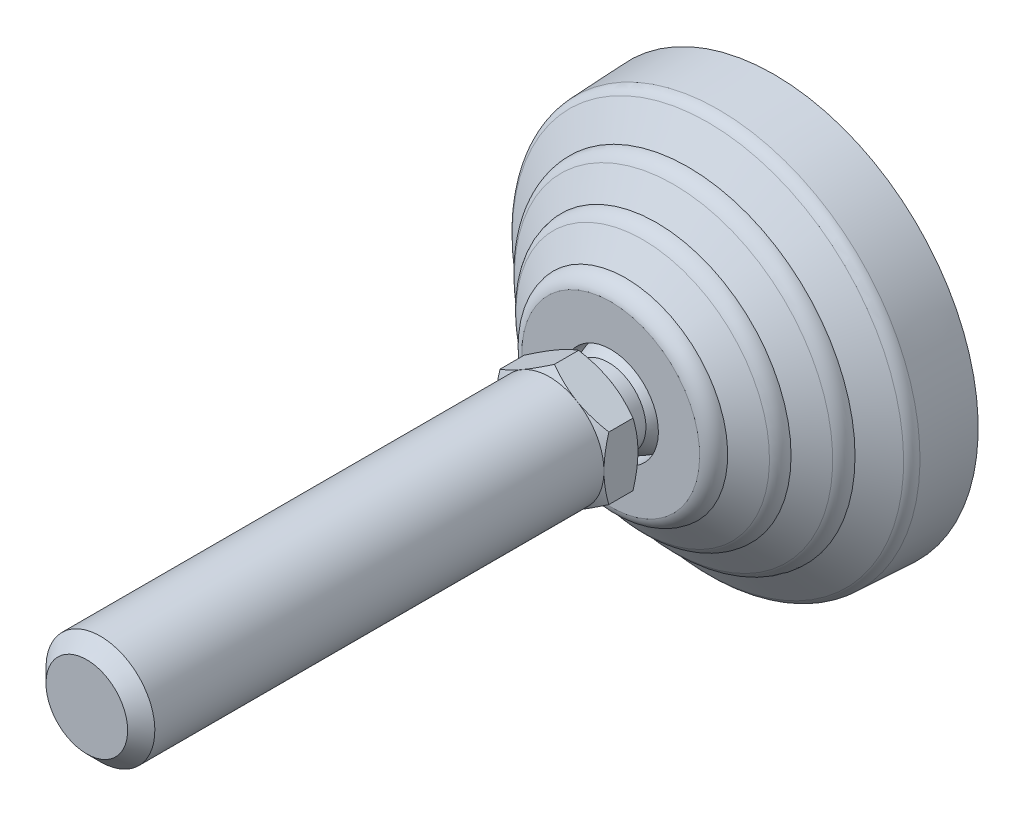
ISO-10303-21;
HEADER;
FILE_DESCRIPTION(('STEP AP214'),'2;1');
FILE_NAME('part.step','',(''),(''),'','','');
FILE_SCHEMA(('AUTOMOTIVE_DESIGN { 1 0 10303 214 1 1 1 1 }'));
ENDSEC;
DATA;
#1=APPLICATION_CONTEXT('core data for automotive mechanical design processes');
#2=APPLICATION_PROTOCOL_DEFINITION('international standard','automotive_design',2000,#1);
#3=PRODUCT_CONTEXT('',#1,'mechanical');
#4=PRODUCT('Part','Part','',(#3));
#5=PRODUCT_RELATED_PRODUCT_CATEGORY('part','',(#4));
#6=PRODUCT_DEFINITION_FORMATION('','',#4);
#7=PRODUCT_DEFINITION_CONTEXT('part definition',#1,'design');
#8=PRODUCT_DEFINITION('design','',#6,#7);
#9=PRODUCT_DEFINITION_SHAPE('','',#8);
#10=(LENGTH_UNIT() NAMED_UNIT(*) SI_UNIT(.MILLI.,.METRE.));
#11=(NAMED_UNIT(*) PLANE_ANGLE_UNIT() SI_UNIT($,.RADIAN.));
#12=(NAMED_UNIT(*) SI_UNIT($,.STERADIAN.) SOLID_ANGLE_UNIT());
#13=UNCERTAINTY_MEASURE_WITH_UNIT(LENGTH_MEASURE(1.E-05),#10,'distance_accuracy_value','');
#14=(GEOMETRIC_REPRESENTATION_CONTEXT(3) GLOBAL_UNCERTAINTY_ASSIGNED_CONTEXT((#13)) GLOBAL_UNIT_ASSIGNED_CONTEXT((#10,
#11,#12)) REPRESENTATION_CONTEXT('',''));
#15=CARTESIAN_POINT('',(0.,0.,0.));
#16=DIRECTION('',(0.,0.,1.));
#17=DIRECTION('',(1.,0.,0.));
#18=AXIS2_PLACEMENT_3D('',#15,#16,#17);
#19=CARTESIAN_POINT('',(0.,0.,32.));
#20=DIRECTION('',(0.,0.,-1.));
#21=DIRECTION('',(0.,1.,0.));
#22=AXIS2_PLACEMENT_3D('',#19,#20,#21);
#23=CYLINDRICAL_SURFACE('',#22,7.);
#24=CARTESIAN_POINT('',(-7.,0.,20.));
#25=CARTESIAN_POINT('',(-7.00000242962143,-0.114537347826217,20.));
#26=CARTESIAN_POINT('',(-6.99718891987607,-0.229074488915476,20.));
#27=CARTESIAN_POINT('',(-6.98594746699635,-0.45787295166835,20.));
#28=CARTESIAN_POINT('',(-6.97751952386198,-0.572134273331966,20.));
#29=CARTESIAN_POINT('',(-6.95506664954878,-0.800105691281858,20.));
#30=CARTESIAN_POINT('',(-6.94104171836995,-0.913815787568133,20.));
#31=CARTESIAN_POINT('',(-6.90742942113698,-1.14041085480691,20.));
#32=CARTESIAN_POINT('',(-6.88784205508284,-1.25329582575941,20.));
#33=CARTESIAN_POINT('',(-6.84315187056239,-1.47796868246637,20.));
#34=CARTESIAN_POINT('',(-6.81804905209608,-1.58975656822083,20.));
#35=CARTESIAN_POINT('',(-6.76238849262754,-1.81196595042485,20.));
#36=CARTESIAN_POINT('',(-6.73183075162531,-1.9223874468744,20.));
#37=CARTESIAN_POINT('',(-6.66533394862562,-2.14159803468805,20.));
#38=CARTESIAN_POINT('',(-6.62939488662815,-2.25038712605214,20.));
#39=CARTESIAN_POINT('',(-6.55222202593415,-2.46607082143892,20.));
#40=CARTESIAN_POINT('',(-6.51098822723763,-2.5729654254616,20.));
#41=CARTESIAN_POINT('',(-6.42332522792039,-2.78460262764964,20.));
#42=CARTESIAN_POINT('',(-6.37689602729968,-2.88934522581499,20.));
#43=CARTESIAN_POINT('',(-6.27895407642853,-3.09642608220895,20.));
#44=CARTESIAN_POINT('',(-6.22744132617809,-3.19876434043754,20.));
#45=CARTESIAN_POINT('',(-6.11945637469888,-3.40078997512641,20.));
#46=CARTESIAN_POINT('',(-6.06298417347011,-3.50047735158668,20.));
#47=CARTESIAN_POINT('',(-5.94521636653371,-3.69696106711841,20.));
#48=CARTESIAN_POINT('',(-5.88392076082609,-3.79375740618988,20.));
#49=CARTESIAN_POINT('',(-5.75665381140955,-3.98422585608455,20.));
#50=CARTESIAN_POINT('',(-5.69068246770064,-4.07789796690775,20.));
#51=CARTESIAN_POINT('',(-5.55422297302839,-4.26189229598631,20.));
#52=CARTESIAN_POINT('',(-5.48373482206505,-4.35221451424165,20.));
#53=CARTESIAN_POINT('',(-5.33841152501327,-4.52929146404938,20.));
#54=CARTESIAN_POINT('',(-5.26357637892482,-4.61604619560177,20.));
#55=CARTESIAN_POINT('',(-5.10973937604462,-4.78577917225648,20.));
#56=CARTESIAN_POINT('',(-5.03073751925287,-4.8687574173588,20.));
#57=CARTESIAN_POINT('',(-4.8687574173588,-5.03073751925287,20.));
#58=CARTESIAN_POINT('',(-4.78577917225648,-5.10973937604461,20.));
#59=CARTESIAN_POINT('',(-4.61604619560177,-5.26357637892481,20.));
#60=CARTESIAN_POINT('',(-4.52929146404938,-5.33841152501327,20.));
#61=CARTESIAN_POINT('',(-4.35221451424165,-5.48373482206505,20.));
#62=CARTESIAN_POINT('',(-4.26189229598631,-5.55422297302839,20.));
#63=CARTESIAN_POINT('',(-4.07789796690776,-5.69068246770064,20.));
#64=CARTESIAN_POINT('',(-3.98422585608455,-5.75665381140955,20.));
#65=CARTESIAN_POINT('',(-3.79375740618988,-5.88392076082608,20.));
#66=CARTESIAN_POINT('',(-3.69696106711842,-5.94521636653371,20.));
#67=CARTESIAN_POINT('',(-3.50047735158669,-6.0629841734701,20.));
#68=CARTESIAN_POINT('',(-3.40078997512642,-6.11945637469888,20.));
#69=CARTESIAN_POINT('',(-3.19876434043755,-6.22744132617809,20.));
#70=CARTESIAN_POINT('',(-3.09642608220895,-6.27895407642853,20.));
#71=CARTESIAN_POINT('',(-2.88934522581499,-6.37689602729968,20.));
#72=CARTESIAN_POINT('',(-2.78460262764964,-6.42332522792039,20.));
#73=CARTESIAN_POINT('',(-2.57296542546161,-6.51098822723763,20.));
#74=CARTESIAN_POINT('',(-2.46607082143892,-6.55222202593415,20.));
#75=CARTESIAN_POINT('',(-2.25038712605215,-6.62939488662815,20.));
#76=CARTESIAN_POINT('',(-2.14159803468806,-6.66533394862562,20.));
#77=CARTESIAN_POINT('',(-1.92238744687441,-6.73183075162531,20.));
#78=CARTESIAN_POINT('',(-1.81196595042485,-6.76238849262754,20.));
#79=CARTESIAN_POINT('',(-1.58975656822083,-6.81804905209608,20.));
#80=CARTESIAN_POINT('',(-1.47796868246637,-6.84315187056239,20.));
#81=CARTESIAN_POINT('',(-1.25329582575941,-6.88784205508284,20.));
#82=CARTESIAN_POINT('',(-1.14041085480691,-6.90742942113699,20.));
#83=CARTESIAN_POINT('',(-0.913815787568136,-6.94104171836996,20.));
#84=CARTESIAN_POINT('',(-0.80010569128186,-6.95506664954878,20.));
#85=CARTESIAN_POINT('',(-0.572134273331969,-6.97751952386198,20.));
#86=CARTESIAN_POINT('',(-0.457872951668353,-6.98594746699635,20.));
#87=CARTESIAN_POINT('',(-0.229074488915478,-6.99718891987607,20.));
#88=CARTESIAN_POINT('',(-0.11453734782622,-7.00000242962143,20.));
#89=CARTESIAN_POINT('',(0.,-7.,20.));
#90=B_SPLINE_CURVE_WITH_KNOTS('',3,(#24,#25,#26,#27,#28,#29,#30,#31,#32,#33,#34,#35,#36,#37,#38,
#39,#40,#41,#42,#43,#44,#45,#46,#47,#48,#49,#50,#51,#52,#53,#54,#55,#56,#57,#58,#59,#60,#61,#62,
#63,#64,#65,#66,#67,#68,#69,#70,#71,#72,#73,#74,#75,#76,#77,#78,#79,#80,#81,#82,#83,#84,#85,#86,
#87,#88,#89),.UNSPECIFIED.,.F.,.F.,(4,2,2,2,2,2,2,2,2,2,2,2,2,2,2,2,2,2,2,2,2,2,2,2,2,2,2,2,2,2,
2,2,4),(0.,0.343577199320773,0.687154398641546,1.03073159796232,1.37430879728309,
1.71788599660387,2.06146319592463,2.40504039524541,2.74861759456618,3.09219479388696,
3.43577199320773,3.7793491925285,4.12292639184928,4.46650359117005,4.81008079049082,
5.15365798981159,5.49723518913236,5.84081238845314,6.18438958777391,6.52796678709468,
6.87154398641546,7.21512118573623,7.558698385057,7.90227558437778,8.24585278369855,
8.58942998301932,8.93300718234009,9.27658438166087,9.62016158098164,9.96373878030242,
10.3073159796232,10.650893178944,10.9944703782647),.UNSPECIFIED.);
#91=CARTESIAN_POINT('',(-7.,0.,20.0001794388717));
#92=VERTEX_POINT('',#91);
#93=CARTESIAN_POINT('',(0.,-7.,20.));
#94=VERTEX_POINT('',#93);
#95=EDGE_CURVE('E138',#92,#94,#90,.T.);
#96=ORIENTED_EDGE('',*,*,#95,.F.);
#97=CARTESIAN_POINT('',(0.,0.,20.));
#98=DIRECTION('',(0.,0.,-1.));
#99=DIRECTION('',(0.,1.,0.));
#100=AXIS2_PLACEMENT_3D('',#97,#98,#99);
#101=CIRCLE('',#100,7.);
#102=CARTESIAN_POINT('',(0.,7.,20.));
#103=VERTEX_POINT('',#102);
#104=EDGE_CURVE('E134',#103,#92,#101,.F.);
#105=ORIENTED_EDGE('',*,*,#104,.F.);
#106=CARTESIAN_POINT('',(7.,0.,20.));
#107=CARTESIAN_POINT('',(7.00000242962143,0.114537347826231,19.9999999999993));
#108=CARTESIAN_POINT('',(6.99718891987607,0.22907448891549,19.9999999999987));
#109=CARTESIAN_POINT('',(6.98594746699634,0.457872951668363,19.9999999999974));
#110=CARTESIAN_POINT('',(6.97751952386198,0.572134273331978,19.9999999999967));
#111=CARTESIAN_POINT('',(6.95506664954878,0.800105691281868,19.9999999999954));
#112=CARTESIAN_POINT('',(6.94104171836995,0.913815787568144,19.9999999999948));
#113=CARTESIAN_POINT('',(6.90742942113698,1.14041085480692,19.9999999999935));
#114=CARTESIAN_POINT('',(6.88784205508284,1.25329582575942,19.9999999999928));
#115=CARTESIAN_POINT('',(6.84315187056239,1.47796868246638,19.9999999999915));
#116=CARTESIAN_POINT('',(6.81804905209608,1.58975656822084,19.9999999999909));
#117=CARTESIAN_POINT('',(6.76238849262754,1.81196595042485,19.9999999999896));
#118=CARTESIAN_POINT('',(6.73183075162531,1.92238744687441,19.999999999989));
#119=CARTESIAN_POINT('',(6.66533394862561,2.14159803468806,19.9999999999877));
#120=CARTESIAN_POINT('',(6.62939488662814,2.25038712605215,19.9999999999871));
#121=CARTESIAN_POINT('',(6.55222202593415,2.46607082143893,19.9999999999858));
#122=CARTESIAN_POINT('',(6.51098822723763,2.57296542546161,19.9999999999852));
#123=CARTESIAN_POINT('',(6.42332522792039,2.78460262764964,19.999999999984));
#124=CARTESIAN_POINT('',(6.37689602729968,2.889345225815,19.9999999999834));
#125=CARTESIAN_POINT('',(6.27895407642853,3.09642608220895,19.9999999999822));
#126=CARTESIAN_POINT('',(6.22744132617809,3.19876434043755,19.9999999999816));
#127=CARTESIAN_POINT('',(6.11945637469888,3.40078997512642,19.9999999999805));
#128=CARTESIAN_POINT('',(6.06298417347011,3.50047735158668,19.9999999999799));
#129=CARTESIAN_POINT('',(5.94521636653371,3.69696106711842,19.9999999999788));
#130=CARTESIAN_POINT('',(5.88392076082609,3.79375740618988,19.9999999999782));
#131=CARTESIAN_POINT('',(5.75665381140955,3.98422585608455,19.9999999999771));
#132=CARTESIAN_POINT('',(5.69068246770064,4.07789796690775,19.9999999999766));
#133=CARTESIAN_POINT('',(5.55422297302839,4.26189229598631,19.9999999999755));
#134=CARTESIAN_POINT('',(5.48373482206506,4.35221451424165,19.999999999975));
#135=CARTESIAN_POINT('',(5.33841152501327,4.52929146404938,19.999999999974));
#136=CARTESIAN_POINT('',(5.26357637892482,4.61604619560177,19.9999999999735));
#137=CARTESIAN_POINT('',(5.10973937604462,4.78577917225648,19.9999999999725));
#138=CARTESIAN_POINT('',(5.03073751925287,4.8687574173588,19.9999999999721));
#139=CARTESIAN_POINT('',(4.8687574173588,5.03073751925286,19.9999999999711));
#140=CARTESIAN_POINT('',(4.78577917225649,5.10973937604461,19.9999999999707));
#141=CARTESIAN_POINT('',(4.61604619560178,5.26357637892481,19.9999999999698));
#142=CARTESIAN_POINT('',(4.52929146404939,5.33841152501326,19.9999999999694));
#143=CARTESIAN_POINT('',(4.35221451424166,5.48373482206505,19.9999999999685));
#144=CARTESIAN_POINT('',(4.26189229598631,5.55422297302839,19.9999999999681));
#145=CARTESIAN_POINT('',(4.07789796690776,5.69068246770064,19.9999999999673));
#146=CARTESIAN_POINT('',(3.98422585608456,5.75665381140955,19.999999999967));
#147=CARTESIAN_POINT('',(3.79375740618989,5.88392076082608,19.9999999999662));
#148=CARTESIAN_POINT('',(3.69696106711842,5.9452163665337,19.9999999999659));
#149=CARTESIAN_POINT('',(3.50047735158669,6.0629841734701,19.9999999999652));
#150=CARTESIAN_POINT('',(3.40078997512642,6.11945637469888,19.9999999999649));
#151=CARTESIAN_POINT('',(3.19876434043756,6.22744132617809,19.9999999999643));
#152=CARTESIAN_POINT('',(3.09642608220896,6.27895407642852,19.999999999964));
#153=CARTESIAN_POINT('',(2.88934522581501,6.37689602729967,19.9999999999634));
#154=CARTESIAN_POINT('',(2.78460262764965,6.42332522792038,19.9999999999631));
#155=CARTESIAN_POINT('',(2.57296542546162,6.51098822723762,19.9999999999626));
#156=CARTESIAN_POINT('',(2.46607082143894,6.55222202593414,19.9999999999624));
#157=CARTESIAN_POINT('',(2.25038712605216,6.62939488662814,19.999999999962));
#158=CARTESIAN_POINT('',(2.14159803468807,6.66533394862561,19.9999999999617));
#159=CARTESIAN_POINT('',(1.92238744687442,6.73183075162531,19.9999999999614));
#160=CARTESIAN_POINT('',(1.81196595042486,6.76238849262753,19.9999999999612));
#161=CARTESIAN_POINT('',(1.58975656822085,6.81804905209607,19.9999999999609));
#162=CARTESIAN_POINT('',(1.47796868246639,6.84315187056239,19.9999999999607));
#163=CARTESIAN_POINT('',(1.25329582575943,6.88784205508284,19.9999999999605));
#164=CARTESIAN_POINT('',(1.14041085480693,6.90742942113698,19.9999999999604));
#165=CARTESIAN_POINT('',(0.913815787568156,6.94104171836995,19.9999999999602));
#166=CARTESIAN_POINT('',(0.80010569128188,6.95506664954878,19.9999999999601));
#167=CARTESIAN_POINT('',(0.57213427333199,6.97751952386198,19.99999999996));
#168=CARTESIAN_POINT('',(0.457872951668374,6.98594746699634,19.9999999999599));
#169=CARTESIAN_POINT('',(0.229074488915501,6.99718891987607,19.9999999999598));
#170=CARTESIAN_POINT('',(0.114537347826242,7.00000242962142,19.9999999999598));
#171=CARTESIAN_POINT('',(0.,7.,19.9999999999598));
#172=B_SPLINE_CURVE_WITH_KNOTS('',3,(#106,#107,#108,#109,#110,#111,#112,#113,#114,#115,#116,
#117,#118,#119,#120,#121,#122,#123,#124,#125,#126,#127,#128,#129,#130,#131,#132,#133,#134,#135,
#136,#137,#138,#139,#140,#141,#142,#143,#144,#145,#146,#147,#148,#149,#150,#151,#152,#153,#154,
#155,#156,#157,#158,#159,#160,#161,#162,#163,#164,#165,#166,#167,#168,#169,#170,#171),
.UNSPECIFIED.,.F.,.F.,(4,2,2,2,2,2,2,2,2,2,2,2,2,2,2,2,2,2,2,2,2,2,2,2,2,2,2,2,2,2,2,2,4),(0.,
0.343577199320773,0.687154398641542,1.03073159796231,1.37430879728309,1.71788599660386,
2.06146319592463,2.4050403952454,2.74861759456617,3.09219479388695,3.43577199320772,
3.77934919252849,4.12292639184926,4.46650359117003,4.8100807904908,5.15365798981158,
5.49723518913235,5.84081238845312,6.18438958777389,6.52796678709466,6.87154398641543,
7.21512118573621,7.55869838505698,7.90227558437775,8.24585278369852,8.58942998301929,
8.93300718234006,9.27658438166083,9.62016158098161,9.96373878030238,10.3073159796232,
10.6508931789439,10.9944703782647),.UNSPECIFIED.);
#173=CARTESIAN_POINT('',(7.,0.,20.));
#174=VERTEX_POINT('',#173);
#175=EDGE_CURVE('E31',#174,#103,#172,.T.);
#176=ORIENTED_EDGE('',*,*,#175,.F.);
#177=CARTESIAN_POINT('',(0.,0.,20.));
#178=DIRECTION('',(0.,0.,-1.));
#179=DIRECTION('',(0.,1.,0.));
#180=AXIS2_PLACEMENT_3D('',#177,#178,#179);
#181=CIRCLE('',#180,7.);
#182=EDGE_CURVE('E135',#94,#174,#181,.F.);
#183=ORIENTED_EDGE('',*,*,#182,.F.);
#184=EDGE_LOOP('',(#96,#105,#176,#183));
#185=FACE_BOUND('',#184,.T.);
#186=CARTESIAN_POINT('',(0.,0.,24.));
#187=DIRECTION('',(0.,0.,-1.));
#188=DIRECTION('',(0.,1.,0.));
#189=AXIS2_PLACEMENT_3D('',#186,#187,#188);
#190=CIRCLE('',#189,7.);
#191=CARTESIAN_POINT('',(0.,7.,24.));
#192=VERTEX_POINT('',#191);
#193=EDGE_CURVE('E155',#192,#192,#190,.T.);
#194=ORIENTED_EDGE('',*,*,#193,.F.);
#195=EDGE_LOOP('',(#194));
#196=FACE_BOUND('',#195,.T.);
#197=ADVANCED_FACE('F14',(#185,#196),#23,.F.);
#198=CARTESIAN_POINT('',(-6.53226682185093,0.,24.));
#199=DIRECTION('',(0.,0.,1.));
#200=DIRECTION('',(-1.,0.,0.));
#201=AXIS2_PLACEMENT_3D('',#198,#199,#200);
#202=PLANE('',#201);
#203=CARTESIAN_POINT('',(0.,0.,24.));
#204=DIRECTION('',(0.,0.,-1.));
#205=DIRECTION('',(0.,1.,0.));
#206=AXIS2_PLACEMENT_3D('',#203,#204,#205);
#207=CIRCLE('',#206,13.0645336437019);
#208=CARTESIAN_POINT('',(0.,13.0645336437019,24.));
#209=VERTEX_POINT('',#208);
#210=EDGE_CURVE('E151',#209,#209,#207,.T.);
#211=ORIENTED_EDGE('',*,*,#210,.F.);
#212=EDGE_LOOP('',(#211));
#213=FACE_BOUND('',#212,.T.);
#214=ORIENTED_EDGE('',*,*,#193,.T.);
#215=EDGE_LOOP('',(#214));
#216=FACE_BOUND('',#215,.T.);
#217=ADVANCED_FACE('F364',(#213,#216),#202,.T.);
#218=CARTESIAN_POINT('',(0.,0.,21.5842));
#219=DIRECTION('',(0.,0.,-1.));
#220=DIRECTION('',(0.,1.,0.));
#221=AXIS2_PLACEMENT_3D('',#218,#219,#220);
#222=TOROIDAL_SURFACE('',#221,12.5253,2.47525);
#223=ORIENTED_EDGE('',*,*,#210,.T.);
#224=EDGE_LOOP('',(#223));
#225=FACE_BOUND('',#224,.T.);
#226=CARTESIAN_POINT('',(0.,0.,21.8062186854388));
#227=DIRECTION('',(0.,0.,-1.));
#228=DIRECTION('',(-1.,0.,0.));
#229=AXIS2_PLACEMENT_3D('',#226,#227,#228);
#230=CIRCLE('',#229,14.9905728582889);
#231=CARTESIAN_POINT('',(-14.9905728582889,0.,21.8062186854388));
#232=VERTEX_POINT('',#231);
#233=EDGE_CURVE('E154',#232,#232,#230,.T.);
#234=ORIENTED_EDGE('',*,*,#233,.F.);
#235=EDGE_LOOP('',(#234));
#236=FACE_BOUND('',#235,.T.);
#237=ADVANCED_FACE('F359',(#225,#236),#222,.T.);
#238=CARTESIAN_POINT('',(0.,0.,19.3004110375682));
#239=DIRECTION('',(0.,0.,-1.));
#240=DIRECTION('',(0.,1.,0.));
#241=AXIS2_PLACEMENT_3D('',#238,#239,#240);
#242=CONICAL_SURFACE('',#241,18.63040749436,0.967870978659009);
#243=ORIENTED_EDGE('',*,*,#233,.T.);
#244=EDGE_LOOP('',(#243));
#245=FACE_BOUND('',#244,.T.);
#246=CARTESIAN_POINT('',(0.,0.,19.3004110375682));
#247=DIRECTION('',(0.,0.,-1.));
#248=DIRECTION('',(0.,1.,0.));
#249=AXIS2_PLACEMENT_3D('',#246,#247,#248);
#250=CIRCLE('',#249,18.63040749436);
#251=CARTESIAN_POINT('',(0.,18.63040749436,19.3004110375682));
#252=VERTEX_POINT('',#251);
#253=EDGE_CURVE('E369',#252,#252,#250,.T.);
#254=ORIENTED_EDGE('',*,*,#253,.F.);
#255=EDGE_LOOP('',(#254));
#256=FACE_BOUND('',#255,.T.);
#257=ADVANCED_FACE('F355',(#245,#256),#242,.T.);
#258=CARTESIAN_POINT('',(0.,0.,17.149417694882));
#259=DIRECTION('',(0.,0.,-1.));
#260=DIRECTION('',(0.,1.,0.));
#261=AXIS2_PLACEMENT_3D('',#258,#259,#260);
#262=TOROIDAL_SURFACE('',#261,17.1699621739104,2.59993709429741);
#263=CARTESIAN_POINT('',(0.,0.,17.266146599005));
#264=DIRECTION('',(0.,0.,-1.));
#265=DIRECTION('',(-1.,0.,0.));
#266=AXIS2_PLACEMENT_3D('',#263,#264,#265);
#267=CIRCLE('',#266,19.7672775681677);
#268=CARTESIAN_POINT('',(-19.7672775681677,0.,17.266146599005));
#269=VERTEX_POINT('',#268);
#270=EDGE_CURVE('E348',#269,#269,#267,.T.);
#271=ORIENTED_EDGE('',*,*,#270,.F.);
#272=EDGE_LOOP('',(#271));
#273=FACE_BOUND('',#272,.T.);
#274=ORIENTED_EDGE('',*,*,#253,.T.);
#275=EDGE_LOOP('',(#274));
#276=FACE_BOUND('',#275,.T.);
#277=ADVANCED_FACE('F352',(#273,#276),#262,.T.);
#278=CARTESIAN_POINT('',(0.,0.,14.7704000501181));
#279=DIRECTION('',(0.,0.,-1.));
#280=DIRECTION('',(0.,1.,0.));
#281=AXIS2_PLACEMENT_3D('',#278,#279,#280);
#282=CONICAL_SURFACE('',#281,23.3925000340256,0.967871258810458);
#283=CARTESIAN_POINT('',(0.,0.,14.7704000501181));
#284=DIRECTION('',(0.,0.,-1.));
#285=DIRECTION('',(0.,1.,0.));
#286=AXIS2_PLACEMENT_3D('',#283,#284,#285);
#287=CIRCLE('',#286,23.3925000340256);
#288=CARTESIAN_POINT('',(0.,23.3925000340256,14.7704000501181));
#289=VERTEX_POINT('',#288);
#290=EDGE_CURVE('E345',#289,#289,#287,.T.);
#291=ORIENTED_EDGE('',*,*,#290,.F.);
#292=EDGE_LOOP('',(#291));
#293=FACE_BOUND('',#292,.T.);
#294=ORIENTED_EDGE('',*,*,#270,.T.);
#295=EDGE_LOOP('',(#294));
#296=FACE_BOUND('',#295,.T.);
#297=ADVANCED_FACE('F338',(#293,#296),#282,.T.);
#298=CARTESIAN_POINT('',(0.,0.,12.6193000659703));
#299=DIRECTION('',(0.,0.,-1.));
#300=DIRECTION('',(0.,1.,0.));
#301=AXIS2_PLACEMENT_3D('',#298,#299,#300);
#302=TOROIDAL_SURFACE('',#301,21.9321002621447,2.59999973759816);
#303=ORIENTED_EDGE('',*,*,#290,.T.);
#304=EDGE_LOOP('',(#303));
#305=FACE_BOUND('',#304,.T.);
#306=CARTESIAN_POINT('',(0.,0.,12.6295138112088));
#307=DIRECTION('',(0.,0.,-1.));
#308=DIRECTION('',(-1.,0.,0.));
#309=AXIS2_PLACEMENT_3D('',#306,#307,#308);
#310=CIRCLE('',#309,24.5320799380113);
#311=CARTESIAN_POINT('',(-24.5320799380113,0.,12.6295138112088));
#312=VERTEX_POINT('',#311);
#313=EDGE_CURVE('E344',#312,#312,#310,.T.);
#314=ORIENTED_EDGE('',*,*,#313,.F.);
#315=EDGE_LOOP('',(#314));
#316=FACE_BOUND('',#315,.T.);
#317=ADVANCED_FACE('F333',(#305,#316),#302,.T.);
#318=CARTESIAN_POINT('',(0.,0.,9.71835625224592));
#319=DIRECTION('',(0.,0.,-1.));
#320=DIRECTION('',(0.,1.,0.));
#321=AXIS2_PLACEMENT_3D('',#318,#319,#320);
#322=CONICAL_SURFACE('',#321,28.760790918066,0.967879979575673);
#323=ORIENTED_EDGE('',*,*,#313,.T.);
#324=EDGE_LOOP('',(#323));
#325=FACE_BOUND('',#324,.T.);
#326=CARTESIAN_POINT('',(0.,0.,9.71835625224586));
#327=DIRECTION('',(0.,0.,-1.));
#328=DIRECTION('',(0.,1.,0.));
#329=AXIS2_PLACEMENT_3D('',#326,#327,#328);
#330=CIRCLE('',#329,28.760790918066);
#331=CARTESIAN_POINT('',(0.,28.760790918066,9.71835625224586));
#332=VERTEX_POINT('',#331);
#333=EDGE_CURVE('E385',#332,#332,#330,.T.);
#334=ORIENTED_EDGE('',*,*,#333,.F.);
#335=EDGE_LOOP('',(#334));
#336=FACE_BOUND('',#335,.T.);
#337=ADVANCED_FACE('F328',(#325,#336),#322,.T.);
#338=CARTESIAN_POINT('',(0.,0.,8.07109690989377));
#339=DIRECTION('',(0.,0.,-1.));
#340=DIRECTION('',(0.,1.,0.));
#341=AXIS2_PLACEMENT_3D('',#338,#339,#340);
#342=TOROIDAL_SURFACE('',#341,27.6268354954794,1.9998295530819);
#343=CARTESIAN_POINT('',(0.,0.,8.17566154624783));
#344=DIRECTION('',(0.,0.,-1.));
#345=DIRECTION('',(-1.,0.,0.));
#346=AXIS2_PLACEMENT_3D('',#343,#344,#345);
#347=CIRCLE('',#346,29.6239295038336);
#348=CARTESIAN_POINT('',(-29.6239295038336,0.,8.17566154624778));
#349=VERTEX_POINT('',#348);
#350=EDGE_CURVE('E150',#349,#349,#347,.T.);
#351=ORIENTED_EDGE('',*,*,#350,.F.);
#352=EDGE_LOOP('',(#351));
#353=FACE_BOUND('',#352,.T.);
#354=ORIENTED_EDGE('',*,*,#333,.T.);
#355=EDGE_LOOP('',(#354));
#356=FACE_BOUND('',#355,.T.);
#357=ADVANCED_FACE('F323',(#353,#356),#342,.T.);
#358=CARTESIAN_POINT('',(0.,0.,0.));
#359=DIRECTION('',(0.,0.,-1.));
#360=DIRECTION('',(0.,1.,0.));
#361=AXIS2_PLACEMENT_3D('',#358,#359,#360);
#362=CONICAL_SURFACE('',#361,30.,0.0459663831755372);
#363=CARTESIAN_POINT('',(0.,0.,0.));
#364=DIRECTION('',(0.,0.,-1.));
#365=DIRECTION('',(0.,1.,0.));
#366=AXIS2_PLACEMENT_3D('',#363,#364,#365);
#367=CIRCLE('',#366,30.);
#368=CARTESIAN_POINT('',(0.,30.,0.));
#369=VERTEX_POINT('',#368);
#370=EDGE_CURVE('E147',#369,#369,#367,.T.);
#371=ORIENTED_EDGE('',*,*,#370,.F.);
#372=EDGE_LOOP('',(#371));
#373=FACE_BOUND('',#372,.T.);
#374=ORIENTED_EDGE('',*,*,#350,.T.);
#375=EDGE_LOOP('',(#374));
#376=FACE_BOUND('',#375,.T.);
#377=ADVANCED_FACE('F327',(#373,#376),#362,.T.);
#378=CARTESIAN_POINT('',(-15.,0.,0.));
#379=DIRECTION('',(0.,0.,-1.));
#380=DIRECTION('',(0.,1.,0.));
#381=AXIS2_PLACEMENT_3D('',#378,#379,#380);
#382=PLANE('',#381);
#383=ORIENTED_EDGE('',*,*,#370,.T.);
#384=EDGE_LOOP('',(#383));
#385=FACE_BOUND('',#384,.T.);
#386=ADVANCED_FACE('F117',(#385),#382,.T.);
#387=CARTESIAN_POINT('',(0.,0.,32.2753734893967));
#388=DIRECTION('',(0.,0.,-1.));
#389=DIRECTION('',(0.,1.,0.));
#390=AXIS2_PLACEMENT_3D('',#387,#388,#389);
#391=CONICAL_SURFACE('',#390,9.2450899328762,1.0471975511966);
#392=CARTESIAN_POINT('',(0.,0.,33.));
#393=DIRECTION('',(0.,0.,-1.));
#394=DIRECTION('',(0.,1.,0.));
#395=AXIS2_PLACEMENT_3D('',#392,#393,#394);
#396=CIRCLE('',#395,7.99);
#397=CARTESIAN_POINT('',(0.,7.99,33.));
#398=VERTEX_POINT('',#397);
#399=EDGE_CURVE('E136',#398,#398,#396,.F.);
#400=ORIENTED_EDGE('',*,*,#399,.F.);
#401=EDGE_LOOP('',(#400));
#402=FACE_BOUND('',#401,.T.);
#403=CARTESIAN_POINT('',(-1.65350869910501E-08,9.23760427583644,32.2796953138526));
#404=CARTESIAN_POINT('',(-0.175847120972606,9.13607891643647,32.3382996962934));
#405=CARTESIAN_POINT('',(-0.352349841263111,9.03417502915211,32.3942441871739));
#406=CARTESIAN_POINT('',(-0.7067886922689,8.82953966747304,32.5000808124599));
#407=CARTESIAN_POINT('',(-0.884725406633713,8.72680785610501,32.5499703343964));
#408=CARTESIAN_POINT('',(-1.42138436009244,8.41696766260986,32.6895770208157));
#409=CARTESIAN_POINT('',(-1.78222497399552,8.2086362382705,32.7689823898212));
#410=CARTESIAN_POINT('',(-2.32221594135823,7.89687230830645,32.8620925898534));
#411=CARTESIAN_POINT('',(-2.4997532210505,7.79437111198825,32.8886166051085));
#412=CARTESIAN_POINT('',(-2.85563056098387,7.58890523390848,32.9330919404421));
#413=CARTESIAN_POINT('',(-3.03397054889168,7.48594059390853,32.9510440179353));
#414=CARTESIAN_POINT('',(-3.39095751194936,7.27983407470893,32.9779205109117));
#415=CARTESIAN_POINT('',(-3.56960390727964,7.1766925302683,32.9868551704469));
#416=CARTESIAN_POINT('',(-3.92706161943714,6.97031422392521,32.9955052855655));
#417=CARTESIAN_POINT('',(-4.10587293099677,6.86707746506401,32.9952210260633));
#418=CARTESIAN_POINT('',(-4.44015433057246,6.67408000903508,32.9860752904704));
#419=CARTESIAN_POINT('',(-4.59564803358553,6.58430567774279,32.9783294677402));
#420=CARTESIAN_POINT('',(-4.90627123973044,6.40496728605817,32.9560167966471));
#421=CARTESIAN_POINT('',(-5.06140071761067,6.31540324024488,32.9414494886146));
#422=CARTESIAN_POINT('',(-5.52618855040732,6.04705785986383,32.8878596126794));
#423=CARTESIAN_POINT('',(-5.83502422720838,5.8687514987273,32.8389557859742));
#424=CARTESIAN_POINT('',(-6.45597114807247,5.51024762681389,32.7166979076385));
#425=CARTESIAN_POINT('',(-6.76800316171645,5.33009585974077,32.6428257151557));
#426=CARTESIAN_POINT('',(-7.38741452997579,4.97247853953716,32.4751673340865));
#427=CARTESIAN_POINT('',(-7.69480181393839,4.7950084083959,32.381420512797));
#428=CARTESIAN_POINT('',(-7.9999999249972,4.6188021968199,32.2796953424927));
#429=B_SPLINE_CURVE_WITH_KNOTS('',3,(#403,#404,#405,#406,#407,#408,#409,#410,#411,#412,#413,
#414,#415,#416,#417,#418,#419,#420,#421,#422,#423,#424,#425,#426,#427,#428),.UNSPECIFIED.,.F.,
.F.,(4,2,2,2,2,2,2,2,2,2,2,2,4),(0.,0.633965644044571,1.26820385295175,2.53931507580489,
3.15930423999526,3.77923861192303,4.39846792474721,5.01767810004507,5.55669077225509,
6.09573977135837,7.17460538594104,8.27739506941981,9.37802044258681),.UNSPECIFIED.);
#430=CARTESIAN_POINT('',(-1.1538685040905E-08,9.23760430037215,32.279695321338));
#431=VERTEX_POINT('',#430);
#432=CARTESIAN_POINT('',(-8.,4.61880217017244,32.2796953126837));
#433=VERTEX_POINT('',#432);
#434=EDGE_CURVE('E100',#431,#433,#429,.T.);
#435=ORIENTED_EDGE('',*,*,#434,.T.);
#436=CARTESIAN_POINT('',(-7.9999999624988,4.6188021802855,32.2796952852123));
#437=CARTESIAN_POINT('',(-7.99999998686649,4.23969380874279,32.3891659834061));
#438=CARTESIAN_POINT('',(-7.999999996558,3.85751175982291,32.4893813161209));
#439=CARTESIAN_POINT('',(-8.00000000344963,3.08693961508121,32.6664987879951));
#440=CARTESIAN_POINT('',(-8.00000000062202,2.69853763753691,32.7433487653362));
#441=CARTESIAN_POINT('',(-7.99999999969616,2.11699996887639,32.8364192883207));
#442=CARTESIAN_POINT('',(-7.99999999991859,1.92560834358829,32.8635449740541));
#443=CARTESIAN_POINT('',(-8.0000000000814,1.54193621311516,32.9104602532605));
#444=CARTESIAN_POINT('',(-8.0000000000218,1.34965578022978,32.9302504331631));
#445=CARTESIAN_POINT('',(-7.99999999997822,0.964645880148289,32.962068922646));
#446=CARTESIAN_POINT('',(-7.99999999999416,0.77191706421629,32.9741050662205));
#447=CARTESIAN_POINT('',(-8.00000000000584,0.386125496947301,32.9901838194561));
#448=CARTESIAN_POINT('',(-8.00000000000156,0.193062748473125,32.9942264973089));
#449=CARTESIAN_POINT('',(-7.99999999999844,-0.193062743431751,32.9942264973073));
#450=CARTESIAN_POINT('',(-7.99999999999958,-0.386125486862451,32.990183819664));
#451=CARTESIAN_POINT('',(-8.00000000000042,-0.771917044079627,32.9741050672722));
#452=CARTESIAN_POINT('',(-8.00000000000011,-0.96464585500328,32.962068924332));
#453=CARTESIAN_POINT('',(-7.99999999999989,-1.34965574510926,32.930250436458));
#454=CARTESIAN_POINT('',(-7.99999999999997,-1.54193617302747,32.9104602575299));
#455=CARTESIAN_POINT('',(-8.00000000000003,-1.92560829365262,32.8635449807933));
#456=CARTESIAN_POINT('',(-8.00000000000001,-2.11699991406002,32.8364192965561));
#457=CARTESIAN_POINT('',(-7.99999999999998,-2.69853756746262,32.7433487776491));
#458=CARTESIAN_POINT('',(-7.99999999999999,-3.0869395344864,32.6664988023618));
#459=CARTESIAN_POINT('',(-8.00000000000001,-3.85751166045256,32.4893813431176));
#460=CARTESIAN_POINT('',(-8.00000000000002,-4.23969370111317,32.3891660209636));
#461=CARTESIAN_POINT('',(-8.,-4.61880206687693,32.2796953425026));
#462=B_SPLINE_CURVE_WITH_KNOTS('',3,(#436,#437,#438,#439,#440,#441,#442,#443,#444,#445,#446,
#447,#448,#449,#450,#451,#452,#453,#454,#455,#456,#457,#458,#459,#460,#461),.UNSPECIFIED.,.F.,
.F.,(4,2,2,2,2,2,2,2,2,2,2,2,4),(0.,1.18429359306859,2.37121196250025,2.95099639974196,
3.53073447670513,4.10988591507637,4.68903241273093,5.26817889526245,5.84733031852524,
6.42706838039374,7.00685280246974,8.19377114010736,9.37806470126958),.UNSPECIFIED.);
#463=CARTESIAN_POINT('',(-8.00000001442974,-4.61880214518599,32.2796953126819));
#464=VERTEX_POINT('',#463);
#465=EDGE_CURVE('E267',#433,#464,#462,.T.);
#466=ORIENTED_EDGE('',*,*,#465,.T.);
#467=CARTESIAN_POINT('',(-8.00000000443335,-4.61880210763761,32.2796952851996));
#468=CARTESIAN_POINT('',(-7.82415291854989,-4.72032749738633,32.3382996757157));
#469=CARTESIAN_POINT('',(-7.64765020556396,-4.82223139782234,32.3942441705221));
#470=CARTESIAN_POINT('',(-7.29321135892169,-5.02686677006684,32.5000807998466));
#471=CARTESIAN_POINT('',(-7.11527464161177,-5.1295985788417,32.5499703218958));
#472=CARTESIAN_POINT('',(-6.57861568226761,-5.43943876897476,32.6895770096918));
#473=CARTESIAN_POINT('',(-6.21777506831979,-5.64777019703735,32.7689823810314));
#474=CARTESIAN_POINT('',(-5.67778409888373,-5.95953412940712,32.8620925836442));
#475=CARTESIAN_POINT('',(-5.50024681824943,-6.06203532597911,32.8886165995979));
#476=CARTESIAN_POINT('',(-5.14436947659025,-6.26750120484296,32.9330919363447));
#477=CARTESIAN_POINT('',(-4.96602948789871,-6.37046584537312,32.9510440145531));
#478=CARTESIAN_POINT('',(-4.60904252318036,-6.57657236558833,32.9779205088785));
#479=CARTESIAN_POINT('',(-4.43039612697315,-6.67971391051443,32.9868551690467));
#480=CARTESIAN_POINT('',(-4.0729384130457,-6.88609221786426,32.9955052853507));
#481=CARTESIAN_POINT('',(-3.89412710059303,-6.98932897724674,32.995221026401));
#482=CARTESIAN_POINT('',(-3.55984569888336,-7.18232643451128,32.9860752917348));
#483=CARTESIAN_POINT('',(-3.40435199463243,-7.27210076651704,32.9783294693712));
#484=CARTESIAN_POINT('',(-3.09372878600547,-7.45143915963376,32.9560167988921));
#485=CARTESIAN_POINT('',(-2.93859930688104,-7.54100320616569,32.941449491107));
#486=CARTESIAN_POINT('',(-2.47381147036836,-7.80934858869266,32.8878596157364));
#487=CARTESIAN_POINT('',(-2.16497579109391,-7.98765495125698,32.8389557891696));
#488=CARTESIAN_POINT('',(-1.54402886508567,-8.34615882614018,32.7166979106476));
#489=CARTESIAN_POINT('',(-1.2319968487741,-8.52631059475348,32.642825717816));
#490=CARTESIAN_POINT('',(-0.612585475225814,-8.88392791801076,32.4751673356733));
#491=CARTESIAN_POINT('',(-0.305198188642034,-9.06139805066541,32.3814205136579));
#492=CARTESIAN_POINT('',(-7.50027841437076E-08,-9.23760426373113,32.2796953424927));
#493=B_SPLINE_CURVE_WITH_KNOTS('',3,(#467,#468,#469,#470,#471,#472,#473,#474,#475,#476,#477,
#478,#479,#480,#481,#482,#483,#484,#485,#486,#487,#488,#489,#490,#491,#492),.UNSPECIFIED.,.F.,
.F.,(4,2,2,2,2,2,2,2,2,2,2,2,4),(0.,0.633965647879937,1.26820386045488,2.53931509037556,
3.15930425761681,3.77923863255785,4.39846794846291,5.01767812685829,5.55669080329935,
6.09573980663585,7.17460542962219,8.27739512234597,9.37802050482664),.UNSPECIFIED.);
#494=CARTESIAN_POINT('',(-1.44240226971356E-08,-9.23760431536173,32.2796953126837));
#495=VERTEX_POINT('',#494);
#496=EDGE_CURVE('E239',#464,#495,#493,.T.);
#497=ORIENTED_EDGE('',*,*,#496,.T.);
#498=CARTESIAN_POINT('',(-4.19327850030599E-08,-9.23760428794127,32.2796952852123));
#499=CARTESIAN_POINT('',(0.175847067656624,-9.13607893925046,32.3382996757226));
#500=CARTESIAN_POINT('',(0.352349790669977,-9.03417505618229,32.3942441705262));
#501=CARTESIAN_POINT('',(0.706788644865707,-8.82953969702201,32.5000807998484));
#502=CARTESIAN_POINT('',(0.884725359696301,-8.72680788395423,32.5499703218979));
#503=CARTESIAN_POINT('',(1.42138431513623,-8.41696768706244,32.6895770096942));
#504=CARTESIAN_POINT('',(1.78222493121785,-8.20863626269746,32.7689823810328));
#505=CARTESIAN_POINT('',(2.32221590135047,-7.896872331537,32.862092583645));
#506=CARTESIAN_POINT('',(2.49975318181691,-7.79437113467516,32.8886165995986));
#507=CARTESIAN_POINT('',(2.85563052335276,-7.58890525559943,32.9330919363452));
#508=CARTESIAN_POINT('',(3.03397051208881,-7.48594061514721,32.9510440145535));
#509=CARTESIAN_POINT('',(3.3909574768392,-7.27983409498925,32.9779205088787));
#510=CARTESIAN_POINT('',(3.56960387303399,-7.17669255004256,32.9868551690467));
#511=CARTESIAN_POINT('',(3.92706158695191,-6.97031424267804,32.9955052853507));
#512=CARTESIAN_POINT('',(4.10587289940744,-6.86707748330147,32.995221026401));
#513=CARTESIAN_POINT('',(4.44015430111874,-6.67408002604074,32.9860752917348));
#514=CARTESIAN_POINT('',(4.59564800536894,-6.58430569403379,32.9783294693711));
#515=CARTESIAN_POINT('',(4.90627121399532,-6.4049673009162,32.956016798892));
#516=CARTESIAN_POINT('',(5.06140069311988,-6.31540325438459,32.9414494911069));
#517=CARTESIAN_POINT('',(5.52618852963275,-6.04705787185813,32.8878596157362));
#518=CARTESIAN_POINT('',(5.83502420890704,-5.86875150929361,32.8389557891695));
#519=CARTESIAN_POINT('',(6.45597113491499,-5.51024763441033,32.7166979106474));
#520=CARTESIAN_POINT('',(6.76800315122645,-5.33009586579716,32.6428257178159));
#521=CARTESIAN_POINT('',(7.38741452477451,-4.97247854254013,32.4751673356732));
#522=CARTESIAN_POINT('',(7.69480181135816,-4.79500840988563,32.3814205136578));
#523=CARTESIAN_POINT('',(7.9999999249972,-4.6188021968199,32.2796953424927));
#524=B_SPLINE_CURVE_WITH_KNOTS('',3,(#498,#499,#500,#501,#502,#503,#504,#505,#506,#507,#508,
#509,#510,#511,#512,#513,#514,#515,#516,#517,#518,#519,#520,#521,#522,#523),.UNSPECIFIED.,.F.,
.F.,(4,2,2,2,2,2,2,2,2,2,2,2,4),(0.,0.633965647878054,1.26820386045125,2.53931509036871,
3.15930425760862,3.77923863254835,4.39846794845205,5.01767812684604,5.55669080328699,
6.09573980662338,7.17460542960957,8.2773951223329,9.37802050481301),.UNSPECIFIED.);
#525=CARTESIAN_POINT('',(8.,-4.61880217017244,32.2796953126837));
#526=VERTEX_POINT('',#525);
#527=EDGE_CURVE('E230',#495,#526,#524,.T.);
#528=ORIENTED_EDGE('',*,*,#527,.T.);
#529=CARTESIAN_POINT('',(7.9999999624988,-4.6188021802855,32.2796952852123));
#530=CARTESIAN_POINT('',(7.99999998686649,-4.23969380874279,32.3891659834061));
#531=CARTESIAN_POINT('',(7.999999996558,-3.85751175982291,32.4893813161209));
#532=CARTESIAN_POINT('',(8.00000000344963,-3.08693961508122,32.6664987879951));
#533=CARTESIAN_POINT('',(8.00000000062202,-2.69853763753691,32.7433487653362));
#534=CARTESIAN_POINT('',(7.99999999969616,-2.11699996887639,32.8364192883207));
#535=CARTESIAN_POINT('',(7.99999999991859,-1.92560834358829,32.8635449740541));
#536=CARTESIAN_POINT('',(8.0000000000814,-1.54193621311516,32.9104602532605));
#537=CARTESIAN_POINT('',(8.0000000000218,-1.34965578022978,32.9302504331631));
#538=CARTESIAN_POINT('',(7.99999999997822,-0.96464588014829,32.962068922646));
#539=CARTESIAN_POINT('',(7.99999999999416,-0.771917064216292,32.9741050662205));
#540=CARTESIAN_POINT('',(8.00000000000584,-0.386125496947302,32.9901838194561));
#541=CARTESIAN_POINT('',(8.00000000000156,-0.193062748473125,32.9942264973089));
#542=CARTESIAN_POINT('',(7.99999999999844,0.193062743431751,32.9942264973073));
#543=CARTESIAN_POINT('',(7.99999999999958,0.386125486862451,32.990183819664));
#544=CARTESIAN_POINT('',(8.00000000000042,0.771917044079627,32.9741050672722));
#545=CARTESIAN_POINT('',(8.00000000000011,0.96464585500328,32.962068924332));
#546=CARTESIAN_POINT('',(7.99999999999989,1.34965574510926,32.930250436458));
#547=CARTESIAN_POINT('',(7.99999999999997,1.54193617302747,32.9104602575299));
#548=CARTESIAN_POINT('',(8.00000000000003,1.92560829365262,32.8635449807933));
#549=CARTESIAN_POINT('',(8.00000000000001,2.11699991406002,32.8364192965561));
#550=CARTESIAN_POINT('',(7.99999999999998,2.69853756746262,32.7433487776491));
#551=CARTESIAN_POINT('',(7.99999999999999,3.0869395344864,32.6664988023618));
#552=CARTESIAN_POINT('',(8.00000000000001,3.85751166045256,32.4893813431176));
#553=CARTESIAN_POINT('',(8.00000000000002,4.23969370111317,32.3891660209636));
#554=CARTESIAN_POINT('',(8.,4.61880206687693,32.2796953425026));
#555=B_SPLINE_CURVE_WITH_KNOTS('',3,(#529,#530,#531,#532,#533,#534,#535,#536,#537,#538,#539,
#540,#541,#542,#543,#544,#545,#546,#547,#548,#549,#550,#551,#552,#553,#554),.UNSPECIFIED.,.F.,
.F.,(4,2,2,2,2,2,2,2,2,2,2,2,4),(0.,1.1842935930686,2.37121196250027,2.95099639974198,
3.53073447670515,4.10988591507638,4.68903241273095,5.26817889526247,5.84733031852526,
6.42706838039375,7.00685280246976,8.19377114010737,9.37806470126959),.UNSPECIFIED.);
#556=CARTESIAN_POINT('',(8.00000001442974,4.618802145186,32.2796953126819));
#557=VERTEX_POINT('',#556);
#558=EDGE_CURVE('E238',#526,#557,#555,.T.);
#559=ORIENTED_EDGE('',*,*,#558,.T.);
#560=CARTESIAN_POINT('',(8.00000000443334,4.61880210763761,32.2796952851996));
#561=CARTESIAN_POINT('',(7.82415291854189,4.72032749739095,32.3382996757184));
#562=CARTESIAN_POINT('',(7.64765020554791,4.8222313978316,32.3942441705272));
#563=CARTESIAN_POINT('',(7.29321135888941,5.02686677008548,32.500080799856));
#564=CARTESIAN_POINT('',(7.11527464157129,5.12959857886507,32.549970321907));
#565=CARTESIAN_POINT('',(6.57861568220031,5.43943876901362,32.689577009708));
#566=CARTESIAN_POINT('',(6.21777506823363,5.6477701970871,32.7689823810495));
#567=CARTESIAN_POINT('',(5.67778409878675,5.95953412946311,32.8620925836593));
#568=CARTESIAN_POINT('',(5.50024681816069,6.06203532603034,32.8886165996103));
#569=CARTESIAN_POINT('',(5.14436947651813,6.2675012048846,32.9330919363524));
#570=CARTESIAN_POINT('',(4.96602948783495,6.37046584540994,32.9510440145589));
#571=CARTESIAN_POINT('',(4.60904252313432,6.57657236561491,32.977920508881));
#572=CARTESIAN_POINT('',(4.43039612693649,6.6797139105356,32.986855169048));
#573=CARTESIAN_POINT('',(4.0729384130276,6.88609221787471,32.9955052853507));
#574=CARTESIAN_POINT('',(3.89412710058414,6.98932897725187,32.9952210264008));
#575=CARTESIAN_POINT('',(3.55984569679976,7.18232643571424,32.9860752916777));
#576=CARTESIAN_POINT('',(3.40435199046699,7.27210076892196,32.9783294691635));
#577=CARTESIAN_POINT('',(3.09372877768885,7.45143916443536,32.9560167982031));
#578=CARTESIAN_POINT('',(2.93859929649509,7.54100321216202,32.9414494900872));
#579=CARTESIAN_POINT('',(2.47381145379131,7.80934859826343,32.8878596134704));
#580=CARTESIAN_POINT('',(2.16497577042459,7.98765496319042,32.8389557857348));
#581=CARTESIAN_POINT('',(1.54402883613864,8.34615884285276,32.7166979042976));
#582=CARTESIAN_POINT('',(1.23199681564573,8.52631061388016,32.6428257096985));
#583=CARTESIAN_POINT('',(0.612585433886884,8.88392794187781,32.4751673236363));
#584=CARTESIAN_POINT('',(0.305198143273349,9.06139807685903,32.3814204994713));
#585=CARTESIAN_POINT('',(2.56600557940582E-08,9.23760429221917,32.2796953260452));
#586=B_SPLINE_CURVE_WITH_KNOTS('',3,(#560,#561,#562,#563,#564,#565,#566,#567,#568,#569,#570,
#571,#572,#573,#574,#575,#576,#577,#578,#579,#580,#581,#582,#583,#584,#585),.UNSPECIFIED.,.F.,
.F.,(4,2,2,2,2,2,2,2,2,2,2,2,4),(0.,0.633965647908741,1.26820386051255,2.53931509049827,
3.15930425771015,3.77923863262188,4.39846794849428,5.01767812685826,5.55669081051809,
6.09573982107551,7.1746054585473,8.27739516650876,9.37802056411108),.UNSPECIFIED.);
#587=EDGE_CURVE('E258',#557,#431,#586,.T.);
#588=ORIENTED_EDGE('',*,*,#587,.T.);
#589=EDGE_LOOP('',(#435,#466,#497,#528,#559,#588));
#590=FACE_BOUND('',#589,.T.);
#591=ADVANCED_FACE('F249',(#402,#590),#391,.T.);
#592=CARTESIAN_POINT('',(0.,-9.23760430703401,33.1));
#593=DIRECTION('',(0.5,0.866025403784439,0.));
#594=DIRECTION('',(-0.866025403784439,0.5,0.));
#595=AXIS2_PLACEMENT_3D('',#592,#593,#594);
#596=PLANE('',#595);
#597=DIRECTION('',(0.,0.,1.));
#598=VECTOR('',#597,1.);
#599=CARTESIAN_POINT('',(0.,-9.23760430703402,33.1));
#600=LINE('',#599,#598);
#601=CARTESIAN_POINT('',(0.,-9.23760430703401,28.7203046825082));
#602=VERTEX_POINT('',#601);
#603=EDGE_CURVE('E163',#602,#495,#600,.T.);
#604=ORIENTED_EDGE('',*,*,#603,.T.);
#605=ORIENTED_EDGE('',*,*,#496,.F.);
#606=DIRECTION('',(0.,0.,1.));
#607=VECTOR('',#606,1.);
#608=CARTESIAN_POINT('',(-8.,-4.61880215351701,33.1));
#609=LINE('',#608,#607);
#610=CARTESIAN_POINT('',(-8.,-4.61880215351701,28.7203046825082));
#611=VERTEX_POINT('',#610);
#612=EDGE_CURVE('E165',#611,#464,#609,.T.);
#613=ORIENTED_EDGE('',*,*,#612,.F.);
#614=CARTESIAN_POINT('',(0.,-9.23760430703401,28.7203046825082));
#615=CARTESIAN_POINT('',(-0.175847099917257,-9.13607893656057,28.6617003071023));
#616=CARTESIAN_POINT('',(-0.35234981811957,-9.03417504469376,28.6057558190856));
#617=CARTESIAN_POINT('',(-0.706788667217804,-8.82953967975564,28.4999191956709));
#618=CARTESIAN_POINT('',(-0.884725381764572,-8.72680786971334,28.4500296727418));
#619=CARTESIAN_POINT('',(-1.42138433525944,-8.41696767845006,28.3104229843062));
#620=CARTESIAN_POINT('',(-1.78222494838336,-8.20863625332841,28.2310176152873));
#621=CARTESIAN_POINT('',(-2.32221591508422,-7.89687232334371,28.1379074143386));
#622=CARTESIAN_POINT('',(-2.49975319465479,-7.79437112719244,28.1113833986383));
#623=CARTESIAN_POINT('',(-2.8556305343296,-7.5889052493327,28.0669080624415));
#624=CARTESIAN_POINT('',(-3.03397052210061,-7.48594060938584,28.0489559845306));
#625=CARTESIAN_POINT('',(-3.3909574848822,-7.2798340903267,28.0220794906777));
#626=CARTESIAN_POINT('',(-3.56960388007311,-7.17669254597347,28.0131448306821));
#627=CARTESIAN_POINT('',(-3.9270615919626,-6.97031423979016,28.0044947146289));
#628=CARTESIAN_POINT('',(-4.10587290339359,-6.86707748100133,28.0047789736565));
#629=CARTESIAN_POINT('',(-4.44015430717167,-6.67408002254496,28.0139247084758));
#630=CARTESIAN_POINT('',(-4.59564801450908,-6.58430568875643,28.0216705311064));
#631=CARTESIAN_POINT('',(-4.90627122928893,-6.40496729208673,28.0439832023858));
#632=CARTESIAN_POINT('',(-5.06140071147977,-6.3154032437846,28.0585505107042));
#633=CARTESIAN_POINT('',(-5.52618855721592,-6.04705785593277,28.1121403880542));
#634=CARTESIAN_POINT('',(-5.83502424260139,-5.86875148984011,28.161044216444));
#635=CARTESIAN_POINT('',(-6.45597118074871,-5.51024760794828,28.2833020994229));
#636=CARTESIAN_POINT('',(-6.76800320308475,-5.33009583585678,28.3571742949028));
#637=CARTESIAN_POINT('',(-7.38741458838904,-4.97247850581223,28.5248326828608));
#638=CARTESIAN_POINT('',(-7.69480188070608,-4.79500836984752,28.6185795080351));
#639=CARTESIAN_POINT('',(-8.,-4.61880215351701,28.7203046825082));
#640=B_SPLINE_CURVE_WITH_KNOTS('',3,(#614,#615,#616,#617,#618,#619,#620,#621,#622,#623,#624,
#625,#626,#627,#628,#629,#630,#631,#632,#633,#634,#635,#636,#637,#638,#639),.UNSPECIFIED.,.F.,
.F.,(4,2,2,2,2,2,2,2,2,2,2,2,4),(0.,0.633965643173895,1.26820385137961,2.53931507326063,
3.15930423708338,3.77923860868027,4.3984679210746,5.01767809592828,5.55669078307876,
6.0957397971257,7.17460544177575,8.27739515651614,9.37802056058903),.UNSPECIFIED.);
#641=EDGE_CURVE('E164',#602,#611,#640,.T.);
#642=ORIENTED_EDGE('',*,*,#641,.F.);
#643=EDGE_LOOP('',(#604,#605,#613,#642));
#644=FACE_BOUND('',#643,.T.);
#645=ADVANCED_FACE('F222',(#644),#596,.F.);
#646=CARTESIAN_POINT('',(8.,-4.61880215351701,33.1));
#647=DIRECTION('',(-0.5,0.866025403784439,0.));
#648=DIRECTION('',(-0.866025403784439,-0.5,0.));
#649=AXIS2_PLACEMENT_3D('',#646,#647,#648);
#650=PLANE('',#649);
#651=DIRECTION('',(0.,0.,1.));
#652=VECTOR('',#651,1.);
#653=CARTESIAN_POINT('',(8.,-4.61880215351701,33.1));
#654=LINE('',#653,#652);
#655=CARTESIAN_POINT('',(8.,-4.61880215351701,28.7203046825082));
#656=VERTEX_POINT('',#655);
#657=EDGE_CURVE('E160',#656,#526,#654,.T.);
#658=ORIENTED_EDGE('',*,*,#657,.T.);
#659=ORIENTED_EDGE('',*,*,#527,.F.);
#660=ORIENTED_EDGE('',*,*,#603,.F.);
#661=CARTESIAN_POINT('',(8.,-4.61880215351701,28.7203046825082));
#662=CARTESIAN_POINT('',(7.82415290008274,-4.72032752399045,28.6617003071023));
#663=CARTESIAN_POINT('',(7.64765018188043,-4.82223141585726,28.6057558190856));
#664=CARTESIAN_POINT('',(7.2932113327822,-5.02686678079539,28.4999191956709));
#665=CARTESIAN_POINT('',(7.11527461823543,-5.12959859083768,28.4500296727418));
#666=CARTESIAN_POINT('',(6.57861566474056,-5.43943878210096,28.3104229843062));
#667=CARTESIAN_POINT('',(6.21777505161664,-5.64777020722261,28.2310176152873));
#668=CARTESIAN_POINT('',(5.67778408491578,-5.95953413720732,28.1379074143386));
#669=CARTESIAN_POINT('',(5.50024680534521,-6.06203533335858,28.1113833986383));
#670=CARTESIAN_POINT('',(5.14436946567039,-6.26750121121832,28.0669080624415));
#671=CARTESIAN_POINT('',(4.96602947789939,-6.37046585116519,28.0489559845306));
#672=CARTESIAN_POINT('',(4.60904251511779,-6.57657237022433,28.0220794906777));
#673=CARTESIAN_POINT('',(4.43039611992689,-6.67971391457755,28.0131448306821));
#674=CARTESIAN_POINT('',(4.0729384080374,-6.88609222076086,28.0044947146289));
#675=CARTESIAN_POINT('',(3.89412709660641,-6.98932897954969,28.0047789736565));
#676=CARTESIAN_POINT('',(3.55984569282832,-7.18232643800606,28.0139247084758));
#677=CARTESIAN_POINT('',(3.40435198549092,-7.2721007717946,28.0216705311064));
#678=CARTESIAN_POINT('',(3.09372877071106,-7.45143916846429,28.0439832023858));
#679=CARTESIAN_POINT('',(2.93859928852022,-7.54100321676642,28.0585505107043));
#680=CARTESIAN_POINT('',(2.47381144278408,-7.80934860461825,28.1121403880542));
#681=CARTESIAN_POINT('',(2.16497575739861,-7.98765497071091,28.161044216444));
#682=CARTESIAN_POINT('',(1.54402881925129,-8.34615885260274,28.2833020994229));
#683=CARTESIAN_POINT('',(1.23199679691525,-8.52631062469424,28.3571742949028));
#684=CARTESIAN_POINT('',(0.612585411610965,-8.88392795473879,28.5248326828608));
#685=CARTESIAN_POINT('',(0.305198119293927,-9.0613980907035,28.6185795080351));
#686=CARTESIAN_POINT('',(0.,-9.23760430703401,28.7203046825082));
#687=B_SPLINE_CURVE_WITH_KNOTS('',3,(#661,#662,#663,#664,#665,#666,#667,#668,#669,#670,#671,
#672,#673,#674,#675,#676,#677,#678,#679,#680,#681,#682,#683,#684,#685,#686),.UNSPECIFIED.,.F.,
.F.,(4,2,2,2,2,2,2,2,2,2,2,2,4),(0.,0.633965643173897,1.26820385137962,2.53931507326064,
3.15930423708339,3.77923860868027,4.39846792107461,5.01767809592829,5.55669078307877,
6.09573979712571,7.17460544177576,8.27739515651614,9.37802056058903),.UNSPECIFIED.);
#688=EDGE_CURVE('E162',#656,#602,#687,.T.);
#689=ORIENTED_EDGE('',*,*,#688,.F.);
#690=EDGE_LOOP('',(#658,#659,#660,#689));
#691=FACE_BOUND('',#690,.T.);
#692=ADVANCED_FACE('F219',(#691),#650,.F.);
#693=CARTESIAN_POINT('',(-8.,4.61880215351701,33.1));
#694=DIRECTION('',(0.5,-0.866025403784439,0.));
#695=DIRECTION('',(0.866025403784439,0.5,0.));
#696=AXIS2_PLACEMENT_3D('',#693,#694,#695);
#697=PLANE('',#696);
#698=DIRECTION('',(0.,0.,1.));
#699=VECTOR('',#698,1.);
#700=CARTESIAN_POINT('',(-8.,4.61880215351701,33.1));
#701=LINE('',#700,#699);
#702=CARTESIAN_POINT('',(-8.,4.61880215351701,28.7203046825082));
#703=VERTEX_POINT('',#702);
#704=EDGE_CURVE('E96',#703,#433,#701,.T.);
#705=ORIENTED_EDGE('',*,*,#704,.T.);
#706=ORIENTED_EDGE('',*,*,#434,.F.);
#707=DIRECTION('',(0.,0.,1.));
#708=VECTOR('',#707,1.);
#709=CARTESIAN_POINT('',(0.,9.23760430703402,33.1));
#710=LINE('',#709,#708);
#711=CARTESIAN_POINT('',(0.,9.23760430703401,28.7203046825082));
#712=VERTEX_POINT('',#711);
#713=EDGE_CURVE('E80',#712,#431,#710,.T.);
#714=ORIENTED_EDGE('',*,*,#713,.F.);
#715=CARTESIAN_POINT('',(-8.,4.61880215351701,28.7203046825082));
#716=CARTESIAN_POINT('',(-7.82415290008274,4.72032752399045,28.6617003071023));
#717=CARTESIAN_POINT('',(-7.64765018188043,4.82223141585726,28.6057558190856));
#718=CARTESIAN_POINT('',(-7.2932113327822,5.02686678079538,28.4999191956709));
#719=CARTESIAN_POINT('',(-7.11527461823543,5.12959859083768,28.4500296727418));
#720=CARTESIAN_POINT('',(-6.57861566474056,5.43943878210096,28.3104229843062));
#721=CARTESIAN_POINT('',(-6.21777505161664,5.64777020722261,28.2310176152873));
#722=CARTESIAN_POINT('',(-5.67778408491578,5.95953413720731,28.1379074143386));
#723=CARTESIAN_POINT('',(-5.50024680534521,6.06203533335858,28.1113833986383));
#724=CARTESIAN_POINT('',(-5.1443694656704,6.26750121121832,28.0669080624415));
#725=CARTESIAN_POINT('',(-4.96602947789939,6.37046585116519,28.0489559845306));
#726=CARTESIAN_POINT('',(-4.60904251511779,6.57657237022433,28.0220794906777));
#727=CARTESIAN_POINT('',(-4.43039611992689,6.67971391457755,28.0131448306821));
#728=CARTESIAN_POINT('',(-4.0729384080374,6.88609222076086,28.0044947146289));
#729=CARTESIAN_POINT('',(-3.89412709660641,6.98932897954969,28.0047789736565));
#730=CARTESIAN_POINT('',(-3.55984569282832,7.18232643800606,28.0139247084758));
#731=CARTESIAN_POINT('',(-3.40435198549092,7.2721007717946,28.0216705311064));
#732=CARTESIAN_POINT('',(-3.09372877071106,7.45143916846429,28.0439832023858));
#733=CARTESIAN_POINT('',(-2.93859928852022,7.54100321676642,28.0585505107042));
#734=CARTESIAN_POINT('',(-2.47381144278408,7.80934860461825,28.1121403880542));
#735=CARTESIAN_POINT('',(-2.16497575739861,7.98765497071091,28.161044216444));
#736=CARTESIAN_POINT('',(-1.54402881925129,8.34615885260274,28.2833020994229));
#737=CARTESIAN_POINT('',(-1.23199679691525,8.52631062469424,28.3571742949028));
#738=CARTESIAN_POINT('',(-0.612585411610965,8.88392795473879,28.5248326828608));
#739=CARTESIAN_POINT('',(-0.305198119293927,9.0613980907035,28.6185795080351));
#740=CARTESIAN_POINT('',(0.,9.23760430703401,28.7203046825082));
#741=B_SPLINE_CURVE_WITH_KNOTS('',3,(#715,#716,#717,#718,#719,#720,#721,#722,#723,#724,#725,
#726,#727,#728,#729,#730,#731,#732,#733,#734,#735,#736,#737,#738,#739,#740),.UNSPECIFIED.,.F.,
.F.,(4,2,2,2,2,2,2,2,2,2,2,2,4),(0.,0.633965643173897,1.26820385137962,2.53931507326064,
3.15930423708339,3.77923860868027,4.39846792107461,5.01767809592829,5.55669078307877,
6.09573979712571,7.17460544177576,8.27739515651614,9.37802056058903),.UNSPECIFIED.);
#742=EDGE_CURVE('E89',#703,#712,#741,.T.);
#743=ORIENTED_EDGE('',*,*,#742,.F.);
#744=EDGE_LOOP('',(#705,#706,#714,#743));
#745=FACE_BOUND('',#744,.T.);
#746=ADVANCED_FACE('F98',(#745),#697,.F.);
#747=CARTESIAN_POINT('',(-8.,-4.61880215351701,33.1));
#748=DIRECTION('',(1.,0.,0.));
#749=DIRECTION('',(0.,1.,0.));
#750=AXIS2_PLACEMENT_3D('',#747,#748,#749);
#751=PLANE('',#750);
#752=ORIENTED_EDGE('',*,*,#612,.T.);
#753=ORIENTED_EDGE('',*,*,#465,.F.);
#754=ORIENTED_EDGE('',*,*,#704,.F.);
#755=CARTESIAN_POINT('',(-8.,-4.618802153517,28.7203046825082));
#756=CARTESIAN_POINT('',(-8.,-4.23969378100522,28.6108340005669));
#757=CARTESIAN_POINT('',(-8.,-3.85751173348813,28.5106186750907));
#758=CARTESIAN_POINT('',(-8.,-3.08693959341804,28.333501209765));
#759=CARTESIAN_POINT('',(-8.,-2.69853761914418,28.2566512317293));
#760=CARTESIAN_POINT('',(-8.,-2.11699995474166,28.163580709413));
#761=CARTESIAN_POINT('',(-8.,-1.9256083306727,28.1364550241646));
#762=CARTESIAN_POINT('',(-8.,-1.54193620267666,28.0895397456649));
#763=CARTESIAN_POINT('',(-8.,-1.34965577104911,28.0697495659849));
#764=CARTESIAN_POINT('',(-8.,-0.964645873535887,28.0379310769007));
#765=CARTESIAN_POINT('',(-8.,-0.771917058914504,28.0258949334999));
#766=CARTESIAN_POINT('',(-8.,-0.38612549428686,28.0098161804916));
#767=CARTESIAN_POINT('',(-8.,-0.19306274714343,28.0057735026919));
#768=CARTESIAN_POINT('',(-8.,0.19306274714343,28.0057735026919));
#769=CARTESIAN_POINT('',(-8.,0.38612549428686,28.0098161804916));
#770=CARTESIAN_POINT('',(-8.,0.771917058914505,28.0258949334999));
#771=CARTESIAN_POINT('',(-8.,0.964645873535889,28.0379310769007));
#772=CARTESIAN_POINT('',(-8.,1.34965577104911,28.0697495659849));
#773=CARTESIAN_POINT('',(-8.,1.54193620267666,28.0895397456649));
#774=CARTESIAN_POINT('',(-8.,1.9256083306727,28.1364550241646));
#775=CARTESIAN_POINT('',(-8.,2.11699995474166,28.163580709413));
#776=CARTESIAN_POINT('',(-8.,2.69853761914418,28.2566512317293));
#777=CARTESIAN_POINT('',(-8.,3.08693959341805,28.333501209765));
#778=CARTESIAN_POINT('',(-8.,3.85751173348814,28.5106186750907));
#779=CARTESIAN_POINT('',(-8.,4.23969378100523,28.6108340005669));
#780=CARTESIAN_POINT('',(-8.,4.61880215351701,28.7203046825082));
#781=B_SPLINE_CURVE_WITH_KNOTS('',3,(#755,#756,#757,#758,#759,#760,#761,#762,#763,#764,#765,
#766,#767,#768,#769,#770,#771,#772,#773,#774,#775,#776,#777,#778,#779,#780),.UNSPECIFIED.,.F.,
.F.,(4,2,2,2,2,2,2,2,2,2,2,2,4),(0.,1.18429358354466,2.37121194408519,2.95099637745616,
3.53073445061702,4.10988588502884,4.68903237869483,5.26817887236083,5.84733030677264,
6.42706837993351,7.00685281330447,8.19377117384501,9.37806475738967),.UNSPECIFIED.);
#782=EDGE_CURVE('E92',#611,#703,#781,.T.);
#783=ORIENTED_EDGE('',*,*,#782,.F.);
#784=EDGE_LOOP('',(#752,#753,#754,#783));
#785=FACE_BOUND('',#784,.T.);
#786=ADVANCED_FACE('F188',(#785),#751,.F.);
#787=CARTESIAN_POINT('',(8.,4.61880215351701,33.1));
#788=DIRECTION('',(-1.,0.,0.));
#789=DIRECTION('',(0.,-1.,0.));
#790=AXIS2_PLACEMENT_3D('',#787,#788,#789);
#791=PLANE('',#790);
#792=DIRECTION('',(0.,0.,1.));
#793=VECTOR('',#792,1.);
#794=CARTESIAN_POINT('',(8.,4.61880215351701,33.1));
#795=LINE('',#794,#793);
#796=CARTESIAN_POINT('',(8.,4.61880215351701,28.7203046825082));
#797=VERTEX_POINT('',#796);
#798=EDGE_CURVE('E83',#557,#797,#795,.F.);
#799=ORIENTED_EDGE('',*,*,#798,.F.);
#800=ORIENTED_EDGE('',*,*,#558,.F.);
#801=ORIENTED_EDGE('',*,*,#657,.F.);
#802=CARTESIAN_POINT('',(8.,4.618802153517,28.7203046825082));
#803=CARTESIAN_POINT('',(8.,4.23969378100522,28.6108340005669));
#804=CARTESIAN_POINT('',(8.,3.85751173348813,28.5106186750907));
#805=CARTESIAN_POINT('',(8.,3.08693959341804,28.333501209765));
#806=CARTESIAN_POINT('',(8.,2.69853761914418,28.2566512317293));
#807=CARTESIAN_POINT('',(8.,2.11699995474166,28.163580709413));
#808=CARTESIAN_POINT('',(8.,1.9256083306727,28.1364550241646));
#809=CARTESIAN_POINT('',(8.,1.54193620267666,28.0895397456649));
#810=CARTESIAN_POINT('',(8.,1.34965577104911,28.0697495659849));
#811=CARTESIAN_POINT('',(8.,0.964645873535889,28.0379310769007));
#812=CARTESIAN_POINT('',(8.,0.771917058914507,28.0258949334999));
#813=CARTESIAN_POINT('',(8.,0.386125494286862,28.0098161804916));
#814=CARTESIAN_POINT('',(8.,0.193062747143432,28.0057735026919));
#815=CARTESIAN_POINT('',(8.,-0.193062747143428,28.0057735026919));
#816=CARTESIAN_POINT('',(8.,-0.386125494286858,28.0098161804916));
#817=CARTESIAN_POINT('',(8.,-0.771917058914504,28.0258949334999));
#818=CARTESIAN_POINT('',(8.,-0.964645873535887,28.0379310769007));
#819=CARTESIAN_POINT('',(8.,-1.34965577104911,28.0697495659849));
#820=CARTESIAN_POINT('',(8.,-1.54193620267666,28.0895397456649));
#821=CARTESIAN_POINT('',(8.,-1.9256083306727,28.1364550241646));
#822=CARTESIAN_POINT('',(8.,-2.11699995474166,28.163580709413));
#823=CARTESIAN_POINT('',(8.,-2.69853761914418,28.2566512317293));
#824=CARTESIAN_POINT('',(8.,-3.08693959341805,28.333501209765));
#825=CARTESIAN_POINT('',(8.,-3.85751173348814,28.5106186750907));
#826=CARTESIAN_POINT('',(8.,-4.23969378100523,28.6108340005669));
#827=CARTESIAN_POINT('',(8.,-4.61880215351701,28.7203046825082));
#828=B_SPLINE_CURVE_WITH_KNOTS('',3,(#802,#803,#804,#805,#806,#807,#808,#809,#810,#811,#812,
#813,#814,#815,#816,#817,#818,#819,#820,#821,#822,#823,#824,#825,#826,#827),.UNSPECIFIED.,.F.,
.F.,(4,2,2,2,2,2,2,2,2,2,2,2,4),(0.,1.18429358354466,2.37121194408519,2.95099637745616,
3.53073445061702,4.10988588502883,4.68903237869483,5.26817887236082,5.84733030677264,
6.4270683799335,7.00685281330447,8.19377117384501,9.37806475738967),.UNSPECIFIED.);
#829=EDGE_CURVE('E159',#797,#656,#828,.T.);
#830=ORIENTED_EDGE('',*,*,#829,.F.);
#831=EDGE_LOOP('',(#799,#800,#801,#830));
#832=FACE_BOUND('',#831,.T.);
#833=ADVANCED_FACE('F224',(#832),#791,.F.);
#834=CARTESIAN_POINT('',(0.,9.23760430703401,33.1));
#835=DIRECTION('',(-0.5,-0.866025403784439,0.));
#836=DIRECTION('',(0.866025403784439,-0.5,0.));
#837=AXIS2_PLACEMENT_3D('',#834,#835,#836);
#838=PLANE('',#837);
#839=ORIENTED_EDGE('',*,*,#713,.T.);
#840=ORIENTED_EDGE('',*,*,#587,.F.);
#841=ORIENTED_EDGE('',*,*,#798,.T.);
#842=CARTESIAN_POINT('',(0.,9.23760430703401,28.7203046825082));
#843=CARTESIAN_POINT('',(0.175847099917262,9.13607893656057,28.6617003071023));
#844=CARTESIAN_POINT('',(0.352349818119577,9.03417504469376,28.6057558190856));
#845=CARTESIAN_POINT('',(0.706788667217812,8.82953967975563,28.4999191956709));
#846=CARTESIAN_POINT('',(0.884725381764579,8.72680786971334,28.4500296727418));
#847=CARTESIAN_POINT('',(1.42138433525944,8.41696767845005,28.3104229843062));
#848=CARTESIAN_POINT('',(1.78222494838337,8.20863625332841,28.2310176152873));
#849=CARTESIAN_POINT('',(2.32221591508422,7.8968723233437,28.1379074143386));
#850=CARTESIAN_POINT('',(2.49975319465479,7.79437112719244,28.1113833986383));
#851=CARTESIAN_POINT('',(2.85563053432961,7.5889052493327,28.0669080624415));
#852=CARTESIAN_POINT('',(3.03397052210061,7.48594060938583,28.0489559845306));
#853=CARTESIAN_POINT('',(3.39095748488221,7.27983409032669,28.0220794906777));
#854=CARTESIAN_POINT('',(3.56960388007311,7.17669254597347,28.0131448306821));
#855=CARTESIAN_POINT('',(3.9270615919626,6.97031423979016,28.0044947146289));
#856=CARTESIAN_POINT('',(4.10587290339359,6.86707748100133,28.0047789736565));
#857=CARTESIAN_POINT('',(4.44015430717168,6.67408002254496,28.0139247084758));
#858=CARTESIAN_POINT('',(4.59564801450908,6.58430568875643,28.0216705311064));
#859=CARTESIAN_POINT('',(4.90627122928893,6.40496729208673,28.0439832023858));
#860=CARTESIAN_POINT('',(5.06140071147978,6.3154032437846,28.0585505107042));
#861=CARTESIAN_POINT('',(5.52618855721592,6.04705785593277,28.1121403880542));
#862=CARTESIAN_POINT('',(5.83502424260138,5.86875148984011,28.161044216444));
#863=CARTESIAN_POINT('',(6.45597118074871,5.51024760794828,28.2833020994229));
#864=CARTESIAN_POINT('',(6.76800320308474,5.33009583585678,28.3571742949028));
#865=CARTESIAN_POINT('',(7.38741458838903,4.97247850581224,28.5248326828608));
#866=CARTESIAN_POINT('',(7.69480188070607,4.79500836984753,28.6185795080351));
#867=CARTESIAN_POINT('',(8.,4.61880215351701,28.7203046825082));
#868=B_SPLINE_CURVE_WITH_KNOTS('',3,(#842,#843,#844,#845,#846,#847,#848,#849,#850,#851,#852,
#853,#854,#855,#856,#857,#858,#859,#860,#861,#862,#863,#864,#865,#866,#867),.UNSPECIFIED.,.F.,
.F.,(4,2,2,2,2,2,2,2,2,2,2,2,4),(0.,0.633965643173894,1.26820385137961,2.53931507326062,
3.15930423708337,3.77923860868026,4.39846792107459,5.01767809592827,5.55669078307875,
6.09573979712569,7.17460544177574,8.27739515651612,9.37802056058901),.UNSPECIFIED.);
#869=EDGE_CURVE('E75',#712,#797,#868,.T.);
#870=ORIENTED_EDGE('',*,*,#869,.F.);
#871=EDGE_LOOP('',(#839,#840,#841,#870));
#872=FACE_BOUND('',#871,.T.);
#873=ADVANCED_FACE('F77',(#872),#838,.F.);
#874=CARTESIAN_POINT('',(0.,0.,28.7246265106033));
#875=DIRECTION('',(0.,0.,1.));
#876=DIRECTION('',(0.,-1.,0.));
#877=AXIS2_PLACEMENT_3D('',#874,#875,#876);
#878=CONICAL_SURFACE('',#877,9.24508993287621,1.0471975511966);
#879=CARTESIAN_POINT('',(0.,0.,28.));
#880=DIRECTION('',(0.,0.,1.));
#881=DIRECTION('',(0.,-1.,0.));
#882=AXIS2_PLACEMENT_3D('',#879,#880,#881);
#883=CIRCLE('',#882,7.99);
#884=CARTESIAN_POINT('',(0.,-7.99,28.));
#885=VERTEX_POINT('',#884);
#886=EDGE_CURVE('E86',#885,#885,#883,.T.);
#887=ORIENTED_EDGE('',*,*,#886,.T.);
#888=EDGE_LOOP('',(#887));
#889=FACE_BOUND('',#888,.T.);
#890=ORIENTED_EDGE('',*,*,#782,.T.);
#891=ORIENTED_EDGE('',*,*,#742,.T.);
#892=ORIENTED_EDGE('',*,*,#869,.T.);
#893=ORIENTED_EDGE('',*,*,#829,.T.);
#894=ORIENTED_EDGE('',*,*,#688,.T.);
#895=ORIENTED_EDGE('',*,*,#641,.T.);
#896=EDGE_LOOP('',(#890,#891,#892,#893,#894,#895));
#897=FACE_BOUND('',#896,.T.);
#898=ADVANCED_FACE('F90',(#889,#897),#878,.T.);
#899=CARTESIAN_POINT('',(6.745,0.,28.));
#900=DIRECTION('',(0.,0.,-1.));
#901=DIRECTION('',(1.,0.,0.));
#902=AXIS2_PLACEMENT_3D('',#899,#900,#901);
#903=PLANE('',#902);
#904=CARTESIAN_POINT('',(0.,0.,28.));
#905=DIRECTION('',(0.,0.,-1.));
#906=DIRECTION('',(0.,1.,0.));
#907=AXIS2_PLACEMENT_3D('',#904,#905,#906);
#908=CIRCLE('',#907,5.5);
#909=CARTESIAN_POINT('',(0.,5.5,28.));
#910=VERTEX_POINT('',#909);
#911=EDGE_CURVE('E316',#910,#910,#908,.F.);
#912=ORIENTED_EDGE('',*,*,#911,.T.);
#913=EDGE_LOOP('',(#912));
#914=FACE_BOUND('',#913,.T.);
#915=ORIENTED_EDGE('',*,*,#886,.F.);
#916=EDGE_LOOP('',(#915));
#917=FACE_BOUND('',#916,.T.);
#918=ADVANCED_FACE('F193',(#914,#917),#903,.T.);
#919=CARTESIAN_POINT('',(0.,0.,26.1650635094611));
#920=DIRECTION('',(0.,0.,-1.));
#921=DIRECTION('',(0.,1.,0.));
#922=AXIS2_PLACEMENT_3D('',#919,#920,#921);
#923=CYLINDRICAL_SURFACE('',#922,5.5);
#924=ORIENTED_EDGE('',*,*,#911,.F.);
#925=EDGE_LOOP('',(#924));
#926=FACE_BOUND('',#925,.T.);
#927=CARTESIAN_POINT('',(0.,0.,24.3301270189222));
#928=DIRECTION('',(0.,0.,-1.));
#929=DIRECTION('',(0.,1.,0.));
#930=AXIS2_PLACEMENT_3D('',#927,#928,#929);
#931=CIRCLE('',#930,5.5);
#932=CARTESIAN_POINT('',(0.,5.5,24.3301270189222));
#933=VERTEX_POINT('',#932);
#934=EDGE_CURVE('E313',#933,#933,#931,.F.);
#935=ORIENTED_EDGE('',*,*,#934,.T.);
#936=EDGE_LOOP('',(#935));
#937=FACE_BOUND('',#936,.T.);
#938=ADVANCED_FACE('F115',(#926,#937),#923,.T.);
#939=CARTESIAN_POINT('',(0.,0.,20.));
#940=DIRECTION('',(1.,0.,0.));
#941=DIRECTION('',(0.,0.,1.));
#942=AXIS2_PLACEMENT_3D('',#939,#940,#941);
#943=SPHERICAL_SURFACE('',#942,7.);
#944=ORIENTED_EDGE('',*,*,#104,.T.);
#945=ORIENTED_EDGE('',*,*,#95,.T.);
#946=ORIENTED_EDGE('',*,*,#182,.T.);
#947=ORIENTED_EDGE('',*,*,#175,.T.);
#948=EDGE_LOOP('',(#944,#945,#946,#947));
#949=FACE_BOUND('',#948,.T.);
#950=ORIENTED_EDGE('',*,*,#934,.F.);
#951=EDGE_LOOP('',(#950));
#952=FACE_BOUND('',#951,.T.);
#953=ADVANCED_FACE('F110',(#949,#952),#943,.T.);
#954=CARTESIAN_POINT('',(0.,0.,101.));
#955=DIRECTION('',(0.,0.,-1.));
#956=DIRECTION('',(0.,1.,0.));
#957=AXIS2_PLACEMENT_3D('',#954,#955,#956);
#958=CYLINDRICAL_SURFACE('',#957,8.);
#959=CARTESIAN_POINT('',(0.,0.,99.));
#960=DIRECTION('',(0.,0.,1.));
#961=DIRECTION('',(0.,-1.,0.));
#962=AXIS2_PLACEMENT_3D('',#959,#960,#961);
#963=CIRCLE('',#962,8.);
#964=CARTESIAN_POINT('',(0.,-8.,99.));
#965=VERTEX_POINT('',#964);
#966=EDGE_CURVE('E9',#965,#965,#963,.F.);
#967=ORIENTED_EDGE('',*,*,#966,.T.);
#968=EDGE_LOOP('',(#967));
#969=FACE_BOUND('',#968,.T.);
#970=CARTESIAN_POINT('',(0.,0.,33.));
#971=DIRECTION('',(0.,0.,1.));
#972=DIRECTION('',(0.,-1.,0.));
#973=AXIS2_PLACEMENT_3D('',#970,#971,#972);
#974=CIRCLE('',#973,8.);
#975=CARTESIAN_POINT('',(0.,-8.,33.));
#976=VERTEX_POINT('',#975);
#977=EDGE_CURVE('E311',#976,#976,#974,.T.);
#978=ORIENTED_EDGE('',*,*,#977,.T.);
#979=EDGE_LOOP('',(#978));
#980=FACE_BOUND('',#979,.T.);
#981=ADVANCED_FACE('F114',(#969,#980),#958,.T.);
#982=CARTESIAN_POINT('',(0.,0.,33.));
#983=DIRECTION('',(0.,0.,1.));
#984=DIRECTION('',(0.,-1.,0.));
#985=AXIS2_PLACEMENT_3D('',#982,#983,#984);
#986=PLANE('',#985);
#987=ORIENTED_EDGE('',*,*,#399,.T.);
#988=EDGE_LOOP('',(#987));
#989=FACE_BOUND('',#988,.T.);
#990=ORIENTED_EDGE('',*,*,#977,.F.);
#991=EDGE_LOOP('',(#990));
#992=FACE_BOUND('',#991,.T.);
#993=ADVANCED_FACE('F305',(#989,#992),#986,.F.);
#994=CARTESIAN_POINT('',(1.9265,0.,101.));
#995=DIRECTION('',(0.,0.,1.));
#996=DIRECTION('',(0.,-1.,0.));
#997=AXIS2_PLACEMENT_3D('',#994,#995,#996);
#998=PLANE('',#997);
#999=CARTESIAN_POINT('',(0.,0.,101.));
#1000=DIRECTION('',(0.,0.,1.));
#1001=DIRECTION('',(0.,-1.,0.));
#1002=AXIS2_PLACEMENT_3D('',#999,#1000,#1001);
#1003=CIRCLE('',#1002,6.);
#1004=CARTESIAN_POINT('',(0.,-6.,101.));
#1005=VERTEX_POINT('',#1004);
#1006=EDGE_CURVE('E23',#1005,#1005,#1003,.T.);
#1007=ORIENTED_EDGE('',*,*,#1006,.T.);
#1008=EDGE_LOOP('',(#1007));
#1009=FACE_BOUND('',#1008,.T.);
#1010=ADVANCED_FACE('F254',(#1009),#998,.T.);
#1011=CARTESIAN_POINT('',(0.,0.,101.));
#1012=DIRECTION('',(0.,0.,-1.));
#1013=DIRECTION('',(0.,1.,0.));
#1014=AXIS2_PLACEMENT_3D('',#1011,#1012,#1013);
#1015=CONICAL_SURFACE('',#1014,6.,0.785398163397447);
#1016=ORIENTED_EDGE('',*,*,#966,.F.);
#1017=EDGE_LOOP('',(#1016));
#1018=FACE_BOUND('',#1017,.T.);
#1019=ORIENTED_EDGE('',*,*,#1006,.F.);
#1020=EDGE_LOOP('',(#1019));
#1021=FACE_BOUND('',#1020,.T.);
#1022=ADVANCED_FACE('F16',(#1018,#1021),#1015,.T.);
#1023=CLOSED_SHELL('',(#197,#217,#237,#257,#277,#297,#317,#337,#357,#377,#386,#591,#645,#692,
#746,#786,#833,#873,#898,#918,#938,#953,#981,#993,#1010,#1022));
#1024=MANIFOLD_SOLID_BREP('B1',#1023);
#1025=ADVANCED_BREP_SHAPE_REPRESENTATION('',(#18,#1024),#14);
#1026=SHAPE_DEFINITION_REPRESENTATION(#9,#1025);
ENDSEC;
END-ISO-10303-21;
